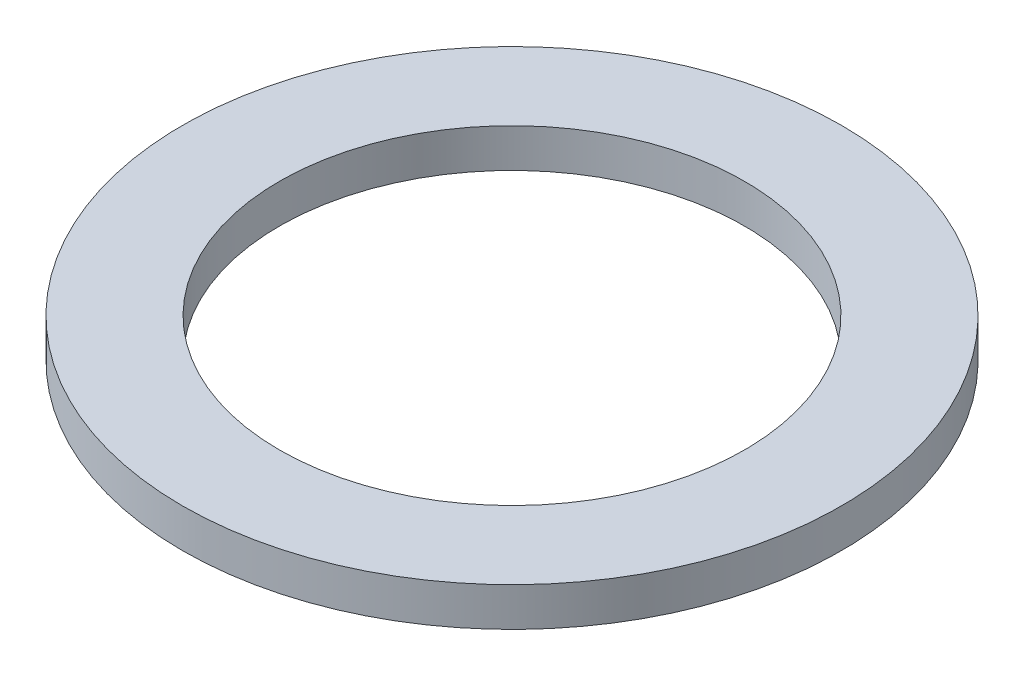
ISO-10303-21;
HEADER;
FILE_DESCRIPTION(('STEP AP214'),'2;1');
FILE_NAME('part.step','',(''),(''),'','','');
FILE_SCHEMA(('AUTOMOTIVE_DESIGN { 1 0 10303 214 1 1 1 1 }'));
ENDSEC;
DATA;
#1=APPLICATION_CONTEXT('core data for automotive mechanical design processes');
#2=APPLICATION_PROTOCOL_DEFINITION('international standard','automotive_design',2000,#1);
#3=PRODUCT_CONTEXT('',#1,'mechanical');
#4=PRODUCT('Part','Part','',(#3));
#5=PRODUCT_RELATED_PRODUCT_CATEGORY('part','',(#4));
#6=PRODUCT_DEFINITION_FORMATION('','',#4);
#7=PRODUCT_DEFINITION_CONTEXT('part definition',#1,'design');
#8=PRODUCT_DEFINITION('design','',#6,#7);
#9=PRODUCT_DEFINITION_SHAPE('','',#8);
#10=(LENGTH_UNIT() NAMED_UNIT(*) SI_UNIT(.MILLI.,.METRE.));
#11=(NAMED_UNIT(*) PLANE_ANGLE_UNIT() SI_UNIT($,.RADIAN.));
#12=(NAMED_UNIT(*) SI_UNIT($,.STERADIAN.) SOLID_ANGLE_UNIT());
#13=UNCERTAINTY_MEASURE_WITH_UNIT(LENGTH_MEASURE(1.E-05),#10,'distance_accuracy_value','');
#14=(GEOMETRIC_REPRESENTATION_CONTEXT(3) GLOBAL_UNCERTAINTY_ASSIGNED_CONTEXT((#13)) GLOBAL_UNIT_ASSIGNED_CONTEXT((#10,
#11,#12)) REPRESENTATION_CONTEXT('',''));
#15=CARTESIAN_POINT('',(0.,0.,0.));
#16=DIRECTION('',(0.,0.,1.));
#17=DIRECTION('',(1.,0.,0.));
#18=AXIS2_PLACEMENT_3D('',#15,#16,#17);
#19=CARTESIAN_POINT('',(0.,0.5,0.));
#20=DIRECTION('',(0.,1.,0.));
#21=DIRECTION('',(0.,0.,1.));
#22=AXIS2_PLACEMENT_3D('',#19,#20,#21);
#23=PLANE('',#22);
#24=CARTESIAN_POINT('',(0.,0.5,0.));
#25=DIRECTION('',(0.,1.,0.));
#26=DIRECTION('',(0.,0.,1.));
#27=AXIS2_PLACEMENT_3D('',#24,#25,#26);
#28=CIRCLE('',#27,4.25);
#29=CARTESIAN_POINT('',(0.,0.5,4.25000000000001));
#30=VERTEX_POINT('',#29);
#31=EDGE_CURVE('E10',#30,#30,#28,.T.);
#32=ORIENTED_EDGE('',*,*,#31,.T.);
#33=EDGE_LOOP('',(#32));
#34=FACE_BOUND('',#33,.T.);
#35=CARTESIAN_POINT('',(0.,0.5,0.));
#36=DIRECTION('',(0.,1.,0.));
#37=DIRECTION('',(0.,0.,1.));
#38=AXIS2_PLACEMENT_3D('',#35,#36,#37);
#39=CIRCLE('',#38,3.);
#40=CARTESIAN_POINT('',(0.,0.5,3.));
#41=VERTEX_POINT('',#40);
#42=EDGE_CURVE('E31',#41,#41,#39,.T.);
#43=ORIENTED_EDGE('',*,*,#42,.F.);
#44=EDGE_LOOP('',(#43));
#45=FACE_BOUND('',#44,.T.);
#46=ADVANCED_FACE('F20',(#34,#45),#23,.T.);
#47=CARTESIAN_POINT('',(0.,0.,0.));
#48=DIRECTION('',(0.,1.,0.));
#49=DIRECTION('',(0.,0.,1.));
#50=AXIS2_PLACEMENT_3D('',#47,#48,#49);
#51=PLANE('',#50);
#52=CARTESIAN_POINT('',(0.,0.,0.));
#53=DIRECTION('',(0.,1.,0.));
#54=DIRECTION('',(0.,0.,1.));
#55=AXIS2_PLACEMENT_3D('',#52,#53,#54);
#56=CIRCLE('',#55,4.25);
#57=CARTESIAN_POINT('',(0.,0.,4.25000000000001));
#58=VERTEX_POINT('',#57);
#59=EDGE_CURVE('E27',#58,#58,#56,.T.);
#60=ORIENTED_EDGE('',*,*,#59,.F.);
#61=EDGE_LOOP('',(#60));
#62=FACE_BOUND('',#61,.T.);
#63=CARTESIAN_POINT('',(0.,0.,0.));
#64=DIRECTION('',(0.,1.,0.));
#65=DIRECTION('',(0.,0.,1.));
#66=AXIS2_PLACEMENT_3D('',#63,#64,#65);
#67=CIRCLE('',#66,3.);
#68=CARTESIAN_POINT('',(0.,0.,3.));
#69=VERTEX_POINT('',#68);
#70=EDGE_CURVE('E35',#69,#69,#67,.T.);
#71=ORIENTED_EDGE('',*,*,#70,.T.);
#72=EDGE_LOOP('',(#71));
#73=FACE_BOUND('',#72,.T.);
#74=ADVANCED_FACE('F41',(#62,#73),#51,.F.);
#75=CARTESIAN_POINT('',(0.,0.5,0.));
#76=DIRECTION('',(0.,-1.,0.));
#77=DIRECTION('',(0.,0.,-1.));
#78=AXIS2_PLACEMENT_3D('',#75,#76,#77);
#79=CYLINDRICAL_SURFACE('',#78,4.25);
#80=ORIENTED_EDGE('',*,*,#31,.F.);
#81=EDGE_LOOP('',(#80));
#82=FACE_BOUND('',#81,.T.);
#83=ORIENTED_EDGE('',*,*,#59,.T.);
#84=EDGE_LOOP('',(#83));
#85=FACE_BOUND('',#84,.T.);
#86=ADVANCED_FACE('F22',(#82,#85),#79,.T.);
#87=CARTESIAN_POINT('',(0.,0.5,0.));
#88=DIRECTION('',(0.,-1.,0.));
#89=DIRECTION('',(0.,0.,-1.));
#90=AXIS2_PLACEMENT_3D('',#87,#88,#89);
#91=CYLINDRICAL_SURFACE('',#90,3.);
#92=ORIENTED_EDGE('',*,*,#42,.T.);
#93=EDGE_LOOP('',(#92));
#94=FACE_BOUND('',#93,.T.);
#95=ORIENTED_EDGE('',*,*,#70,.F.);
#96=EDGE_LOOP('',(#95));
#97=FACE_BOUND('',#96,.T.);
#98=ADVANCED_FACE('F43',(#94,#97),#91,.F.);
#99=CLOSED_SHELL('',(#46,#74,#86,#98));
#100=MANIFOLD_SOLID_BREP('B2',#99);
#101=ADVANCED_BREP_SHAPE_REPRESENTATION('',(#18,#100),#14);
#102=SHAPE_DEFINITION_REPRESENTATION(#9,#101);
ENDSEC;
END-ISO-10303-21;
